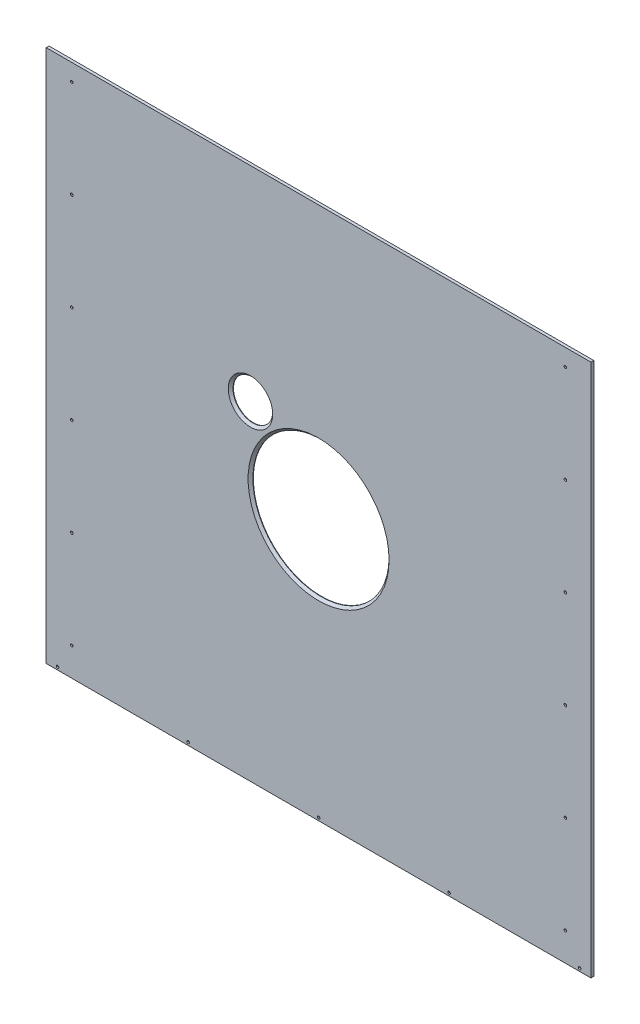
from build123d import *

# Parameters (mm, degrees)
SKETCH1_W                                     = 609.6
SKETCH1_H                                     = 596.9
BOSS_EXTRUDE1_DEPTH                           = 3.175
SKETCH2_R                                     = 76.2
CUT_EXTRUDE1_DEPTH                            = 427.597612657
CSK_FOR_4_FLAT_HEAD_MACHINE_SCREW1_AT_2_COUNT = 2
CSK_FOR_4_FLAT_HEAD_MACHINE_SCREW1_AT_2_PITCH = 109.22
CSK_FOR_4_FLAT_HEAD_MACHINE_SCREW1_AT_3_COUNT = 2
CSK_FOR_4_FLAT_HEAD_MACHINE_SCREW1_AT_3_PITCH = 218.44
CSK_FOR_4_FLAT_HEAD_MACHINE_SCREW1_AT_4_COUNT = 2
CSK_FOR_4_FLAT_HEAD_MACHINE_SCREW1_AT_4_PITCH = 327.66
CSK_FOR_4_FLAT_HEAD_MACHINE_SCREW1_AT_5_COUNT = 2
CSK_FOR_4_FLAT_HEAD_MACHINE_SCREW1_AT_5_PITCH = 436.88
CSK_FOR_4_FLAT_HEAD_MACHINE_SCREW1_AT_6_COUNT = 2
CSK_FOR_4_FLAT_HEAD_MACHINE_SCREW1_AT_6_PITCH = 546.1
CSK_FOR_4_FLAT_HEAD_MACHINE_SCREW1_AT_7_COUNT = 2
CSK_FOR_4_FLAT_HEAD_MACHINE_SCREW1_AT_7_PITCH = 552.45
CSK_FOR_4_FLAT_HEAD_MACHINE_SCREW1_AT_8_COUNT = 2
CSK_FOR_4_FLAT_HEAD_MACHINE_SCREW1_AT_8_PITCH = 563.14297554
CSK_FOR_4_FLAT_HEAD_MACHINE_SCREW1_AT_9_COUNT = 2
CSK_FOR_4_FLAT_HEAD_MACHINE_SCREW1_AT_9_PITCH = 594.068208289
CSK_FOR_4_FLAT_HEAD_MACHINE_SCREW1_AT_1_COUNT = 2
CSK_FOR_4_FLAT_HEAD_MACHINE_SCREW1_AT_1_PITCH = 642.30995485
CSK_FOR_4_FLAT_HEAD_MACHINE_SCREW1_2_COUNT    = 2
CSK_FOR_4_FLAT_HEAD_MACHINE_SCREW1_2_PITCH    = 704.31891704
CSK_FOR_4_FLAT_HEAD_MACHINE_SCREW1_3_COUNT    = 2
CSK_FOR_4_FLAT_HEAD_MACHINE_SCREW1_3_PITCH    = 776.805131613
CSK_FOR_4_FLAT_HEAD_MACHINE_SCREW1_4_COUNT    = 2
CSK_FOR_4_FLAT_HEAD_MACHINE_SCREW1_4_PITCH    = 574.894226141
CSK_FOR_4_FLAT_HEAD_MACHINE_SCREW1_5_COUNT    = 2
CSK_FOR_4_FLAT_HEAD_MACHINE_SCREW1_5_PITCH    = 589.234152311
CSK_FOR_4_FLAT_HEAD_MACHINE_SCREW1_6_COUNT    = 2
CSK_FOR_4_FLAT_HEAD_MACHINE_SCREW1_6_PITCH    = 637.61399471
CSK_FOR_4_FLAT_HEAD_MACHINE_SCREW1_7_COUNT    = 2
CSK_FOR_4_FLAT_HEAD_MACHINE_SCREW1_7_PITCH    = 713.139208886
CSK_FOR_4_FLAT_HEAD_MACHINE_SCREW1_8_COUNT    = 2
CSK_FOR_4_FLAT_HEAD_MACHINE_SCREW1_8_PITCH    = 808.235523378
SKETCH5_R                                     = 22.225
CUT_EXTRUDE2_DEPTH                            = 427.597612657
CHAMFER1_SIZE                                 = 2.667


with BuildPart() as part:
    # Sketch1 → Boss-Extrude1 (new body)
    with BuildSketch(Plane.XY):
        Rectangle(SKETCH1_W, SKETCH1_H)
    extrude(amount=BOSS_EXTRUDE1_DEPTH)

    # Sketch2 → Cut-Extrude1 (cut, through all)
    with BuildSketch(Plane.XY.offset(3.175)):
        with Locations((0, -6.35)):
            Circle(SKETCH2_R)
    extrude(amount=-CUT_EXTRUDE1_DEPTH, mode=Mode.SUBTRACT)

    # Sketch3 → CSK for _4 Flat Head Machine Screw1 (revolve, cut)
    with BuildSketch(Plane(origin=(276.225, 279.4, 0), x_dir=(0, 1, 0), z_dir=(1, 0, 0))):
        Polygon((0, 0), (0, 3.175), (1.4732, 3.175), (1.4732, 1.592454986), (2.8575, 0), align=None)
    csk_for_4_flat_head_machine_screw1 = revolve(axis=Axis((276.225, 279.4, -6.35), (0, 0, 1)), mode=Mode.SUBTRACT)

    # CSK for _4 Flat Head Machine Screw1 at 2: CSK for _4 Flat Head Machine Screw1 ×2
    with Locations(*[(0, -i * CSK_FOR_4_FLAT_HEAD_MACHINE_SCREW1_AT_2_PITCH, 0) for i in range(1, CSK_FOR_4_FLAT_HEAD_MACHINE_SCREW1_AT_2_COUNT)]):
        add(csk_for_4_flat_head_machine_screw1, mode=Mode.SUBTRACT)

    # CSK for _4 Flat Head Machine Screw1 at 3: CSK for _4 Flat Head Machine Screw1 ×2
    with Locations(*[(0, -i * CSK_FOR_4_FLAT_HEAD_MACHINE_SCREW1_AT_3_PITCH, 0) for i in range(1, CSK_FOR_4_FLAT_HEAD_MACHINE_SCREW1_AT_3_COUNT)]):
        add(csk_for_4_flat_head_machine_screw1, mode=Mode.SUBTRACT)

    # CSK for _4 Flat Head Machine Screw1 at 4: CSK for _4 Flat Head Machine Screw1 ×2
    with Locations(*[(0, -i * CSK_FOR_4_FLAT_HEAD_MACHINE_SCREW1_AT_4_PITCH, 0) for i in range(1, CSK_FOR_4_FLAT_HEAD_MACHINE_SCREW1_AT_4_COUNT)]):
        add(csk_for_4_flat_head_machine_screw1, mode=Mode.SUBTRACT)

    # CSK for _4 Flat Head Machine Screw1 at 5: CSK for _4 Flat Head Machine Screw1 ×2
    with Locations(*[(0, -i * CSK_FOR_4_FLAT_HEAD_MACHINE_SCREW1_AT_5_PITCH, 0) for i in range(1, CSK_FOR_4_FLAT_HEAD_MACHINE_SCREW1_AT_5_COUNT)]):
        add(csk_for_4_flat_head_machine_screw1, mode=Mode.SUBTRACT)

    # CSK for _4 Flat Head Machine Screw1 at 6: CSK for _4 Flat Head Machine Screw1 ×2
    with Locations(*[(0, -i * CSK_FOR_4_FLAT_HEAD_MACHINE_SCREW1_AT_6_PITCH, 0) for i in range(1, CSK_FOR_4_FLAT_HEAD_MACHINE_SCREW1_AT_6_COUNT)]):
        add(csk_for_4_flat_head_machine_screw1, mode=Mode.SUBTRACT)

    # CSK for _4 Flat Head Machine Screw1 at 7: CSK for _4 Flat Head Machine Screw1 ×2
    with Locations(*[(-i * CSK_FOR_4_FLAT_HEAD_MACHINE_SCREW1_AT_7_PITCH, 0, 0) for i in range(1, CSK_FOR_4_FLAT_HEAD_MACHINE_SCREW1_AT_7_COUNT)]):
        add(csk_for_4_flat_head_machine_screw1, mode=Mode.SUBTRACT)

    # CSK for _4 Flat Head Machine Screw1 at 8: CSK for _4 Flat Head Machine Screw1 ×2
    with Locations(*[Vector(-0.9810119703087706, -0.19394719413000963, 0) * (i * CSK_FOR_4_FLAT_HEAD_MACHINE_SCREW1_AT_8_PITCH) for i in range(1, CSK_FOR_4_FLAT_HEAD_MACHINE_SCREW1_AT_8_COUNT)]):
        add(csk_for_4_flat_head_machine_screw1, mode=Mode.SUBTRACT)

    # CSK for _4 Flat Head Machine Screw1 at 9: CSK for _4 Flat Head Machine Screw1 ×2
    with Locations(*[Vector(-0.9299437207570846, -0.36770188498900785, 0) * (i * CSK_FOR_4_FLAT_HEAD_MACHINE_SCREW1_AT_9_PITCH) for i in range(1, CSK_FOR_4_FLAT_HEAD_MACHINE_SCREW1_AT_9_COUNT)]):
        add(csk_for_4_flat_head_machine_screw1, mode=Mode.SUBTRACT)

    # CSK for _4 Flat Head Machine Screw1 at 1: CSK for _4 Flat Head Machine Screw1 ×2
    with Locations(*[Vector(-0.860098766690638, -0.5101275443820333, 0) * (i * CSK_FOR_4_FLAT_HEAD_MACHINE_SCREW1_AT_1_PITCH) for i in range(1, CSK_FOR_4_FLAT_HEAD_MACHINE_SCREW1_AT_1_COUNT)]):
        add(csk_for_4_flat_head_machine_screw1, mode=Mode.SUBTRACT)

    # CSK for _4 Flat Head Machine Screw1  2: CSK for _4 Flat Head Machine Screw1 ×2
    with Locations(*[Vector(-0.7843747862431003, -0.6202871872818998, 0) * (i * CSK_FOR_4_FLAT_HEAD_MACHINE_SCREW1_2_PITCH) for i in range(1, CSK_FOR_4_FLAT_HEAD_MACHINE_SCREW1_2_COUNT)]):
        add(csk_for_4_flat_head_machine_screw1, mode=Mode.SUBTRACT)

    # CSK for _4 Flat Head Machine Screw1  3: CSK for _4 Flat Head Machine Screw1 ×2
    with Locations(*[Vector(-0.7111822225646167, -0.7030077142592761, 0) * (i * CSK_FOR_4_FLAT_HEAD_MACHINE_SCREW1_3_PITCH) for i in range(1, CSK_FOR_4_FLAT_HEAD_MACHINE_SCREW1_3_COUNT)]):
        add(csk_for_4_flat_head_machine_screw1, mode=Mode.SUBTRACT)

    # CSK for _4 Flat Head Machine Screw1  4: CSK for _4 Flat Head Machine Screw1 ×2
    with Locations(*[Vector(0.02761377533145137, -0.9996186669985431, 0) * (i * CSK_FOR_4_FLAT_HEAD_MACHINE_SCREW1_4_PITCH) for i in range(1, CSK_FOR_4_FLAT_HEAD_MACHINE_SCREW1_4_COUNT)]):
        add(csk_for_4_flat_head_machine_screw1, mode=Mode.SUBTRACT)

    # CSK for _4 Flat Head Machine Screw1  5: CSK for _4 Flat Head Machine Screw1 ×2
    with Locations(*[Vector(-0.22092236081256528, -0.9752913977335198, 0) * (i * CSK_FOR_4_FLAT_HEAD_MACHINE_SCREW1_5_PITCH) for i in range(1, CSK_FOR_4_FLAT_HEAD_MACHINE_SCREW1_5_COUNT)]):
        add(csk_for_4_flat_head_machine_screw1, mode=Mode.SUBTRACT)

    # CSK for _4 Flat Head Machine Screw1  6: CSK for _4 Flat Head Machine Screw1 ×2
    with Locations(*[Vector(-0.4332166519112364, -0.9012898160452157, 0) * (i * CSK_FOR_4_FLAT_HEAD_MACHINE_SCREW1_6_PITCH) for i in range(1, CSK_FOR_4_FLAT_HEAD_MACHINE_SCREW1_6_COUNT)]):
        add(csk_for_4_flat_head_machine_screw1, mode=Mode.SUBTRACT)

    # CSK for _4 Flat Head Machine Screw1  7: CSK for _4 Flat Head Machine Screw1 ×2
    with Locations(*[Vector(-0.5921354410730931, -0.8058384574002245, 0) * (i * CSK_FOR_4_FLAT_HEAD_MACHINE_SCREW1_7_PITCH) for i in range(1, CSK_FOR_4_FLAT_HEAD_MACHINE_SCREW1_7_COUNT)]):
        add(csk_for_4_flat_head_machine_screw1, mode=Mode.SUBTRACT)

    # CSK for _4 Flat Head Machine Screw1  8: CSK for _4 Flat Head Machine Screw1 ×2
    with Locations(*[Vector(-0.7031675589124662, -0.7110241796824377, 0) * (i * CSK_FOR_4_FLAT_HEAD_MACHINE_SCREW1_8_PITCH) for i in range(1, CSK_FOR_4_FLAT_HEAD_MACHINE_SCREW1_8_COUNT)]):
        add(csk_for_4_flat_head_machine_screw1, mode=Mode.SUBTRACT)

    # Sketch5 → Cut-Extrude2 (cut, through all)
    with BuildSketch(Plane.XY.offset(3.175)):
        with Locations((-76.2, 69.85)):
            Circle(SKETCH5_R)
    extrude(amount=-CUT_EXTRUDE2_DEPTH, mode=Mode.SUBTRACT)

    # Chamfer1
    chamfer1_edges = [part.edges().sort_by_distance(p)[0] for p in [
        (-76.2, -6.35, 3.175),
        (-98.425, 69.85, 3.175),
    ]]
    chamfer(chamfer1_edges, length=CHAMFER1_SIZE)


solid = part.part
